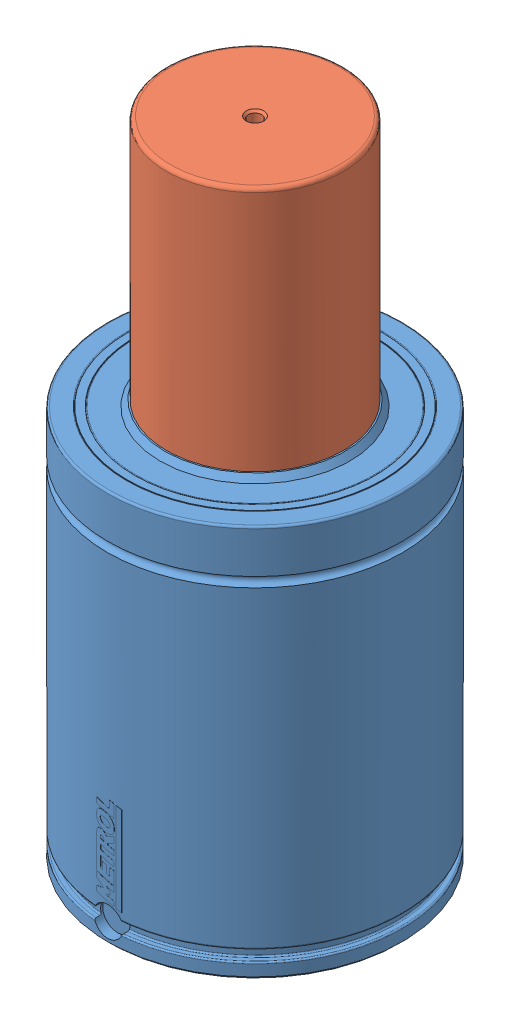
SolidWorks assembly EX9500-125.SLDASM, configuration Default (file format 7000). Lengths in mm.
Overall size (155.56 328 155.56).
2 component instances, 2 part files, 5 mates.
Components (placement in the parent):
- EX-9500 BODY-1: EX-9500 BODY.SLDPRT [EX-9500-125] x (0 0 1) z (0 -1 0) size (150.03 150 203)
- EX-9500 PISTON-1: EX-9500 PISTON.SLDPRT [EX-9500-125] at (0 170 0) x (0.701743 0 -0.71243) z (0 -1 0) size (110 110 158)
Mates (geometry in assembly coordinates):
- Concentric1: concentric aligned: cylinder of EX-9500 BODY-1 through (0 0 0) axis (0 -1 0) radius 75; cylinder of EX-9500 PISTON-1 through (0 170 0) axis (0 -1 0) radius 45
- LimitDistance1: limit distance anti-aligned: plane of EX-9500 BODY-1 through (-45 180 0) normal (0 -1 0); plane of EX-9500 PISTON-1 through (32.0593 180 31.5785) normal (0 1 0)
- Coincident1: coincident anti-aligned: plane of EX-9500 BODY-1 through (0 0 0) normal (0 -1 0); plane of assembly through (0 0 0) normal (0 1 0)
- Coincident2: coincident aligned: plane of EX-9500 BODY-1; plane of assembly through (0 0 0) normal (0 0 1)
- Coincident4: coincident anti-aligned: plane of EX-9500 BODY-1; plane of assembly through (0 0 0) normal (1 0 0)
